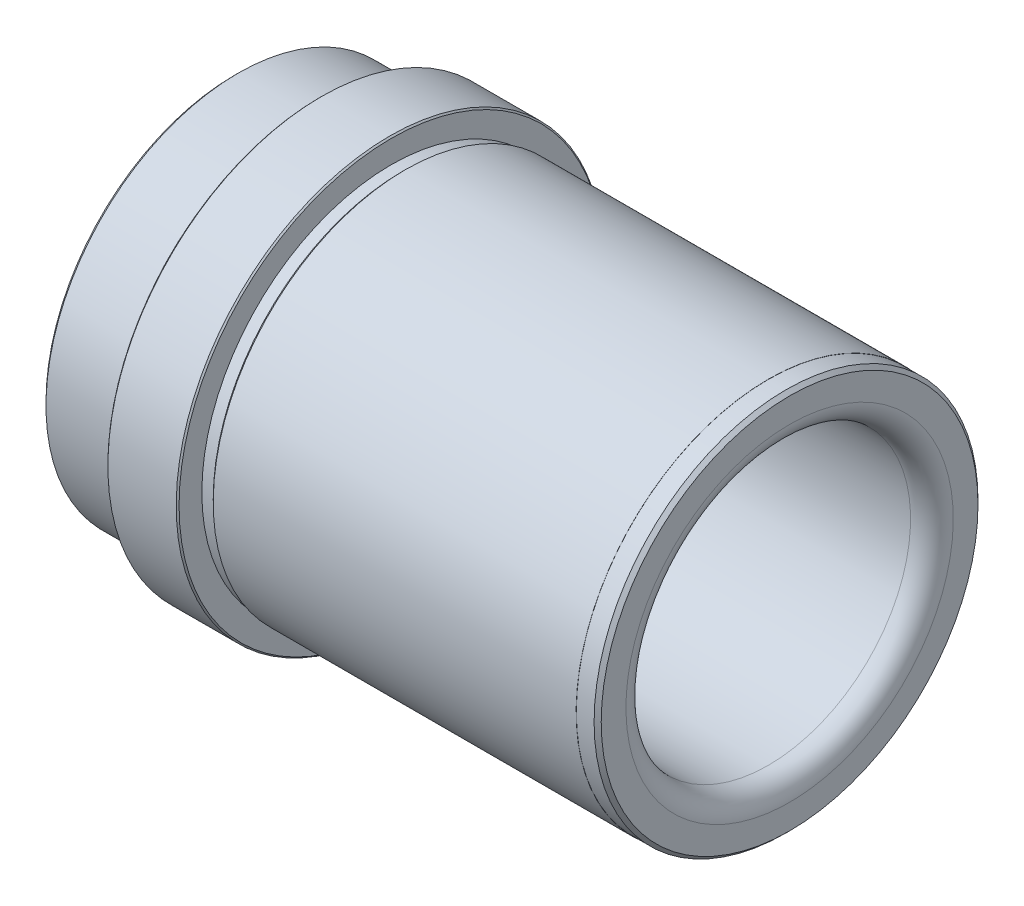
from build123d import *

# Parameters (mm, degrees)
SKETCH2_R      = 20
EXTRUDE1_DEPTH = 116
FILLET2_R      = 3
CHAMFER3_SIZE  = 0.5
CHAMFER4_SIZE  = 0.2
CHAMFER5_SIZE  = 0.5


with BuildPart() as part:
    # Sketch1 → Revolve1 (revolve)
    with BuildSketch(Plane.XY):
        Polygon((36, 27), (-15, 27), (-15.4, 26.6), (-17, 26.6), (-17, 30), (-27, 30), (-27, 26.6), (-28.6, 26.6), (-29, 27), (-39, 27), (-39, 0), (39, 0), (39, 26.975), (36, 26.975), align=None)
    revolve(axis=Axis((39, 0, 0), (-1, 0, 0)))

    # Sketch2 → Extrude1 (cut)
    with BuildSketch(Plane(origin=(39, 0, 0), x_dir=(0, 0, -1), z_dir=(1, 0, 0))):
        with Locations(Location((0, 0, 0), (0, 0, 90))):
            Circle(SKETCH2_R)
    extrude(amount=-EXTRUDE1_DEPTH, mode=Mode.SUBTRACT)

    # Fillet2
    fillet2_edges = [part.edges().sort_by_distance(p)[0] for p in [
        (39, -20, 0),
    ]]
    fillet(fillet2_edges, radius=FILLET2_R)

    # Chamfer3
    chamfer3_edges = [part.edges().sort_by_distance(p)[0] for p in [
        (39, -26.975, 0),
    ]]
    chamfer(chamfer3_edges, length=CHAMFER3_SIZE)

    # Chamfer4
    chamfer4_edges = [part.edges().sort_by_distance(p)[0] for p in [
        (-27, -30, 0),
        (-17, -30, 0),
    ]]
    chamfer(chamfer4_edges, length=CHAMFER4_SIZE)

    # Chamfer5
    chamfer5_edges = [part.edges().sort_by_distance(p)[0] for p in [
        (-39, -27, 0),
        (-39, -20, 0),
    ]]
    chamfer(chamfer5_edges, length=CHAMFER5_SIZE)


solid = part.part
